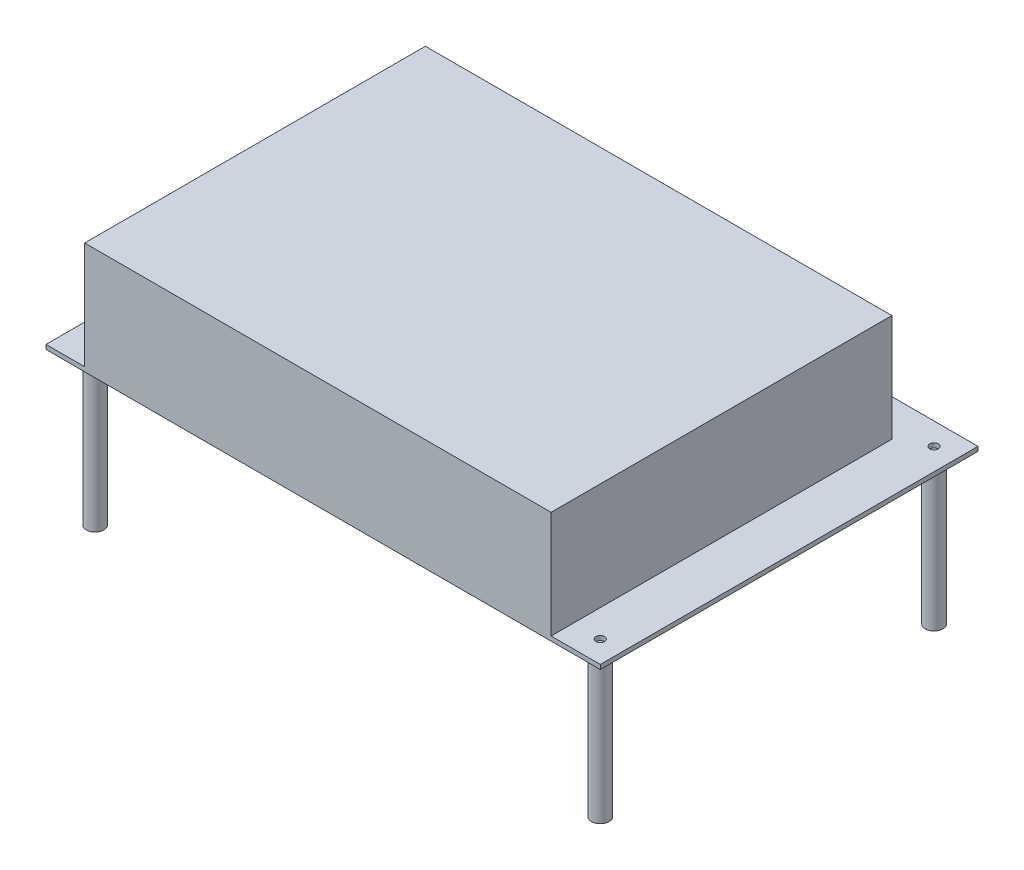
ISO-10303-21;
HEADER;
FILE_DESCRIPTION(('STEP AP214'),'2;1');
FILE_NAME('part.step','',(''),(''),'','','');
FILE_SCHEMA(('AUTOMOTIVE_DESIGN { 1 0 10303 214 1 1 1 1 }'));
ENDSEC;
DATA;
#1=APPLICATION_CONTEXT('core data for automotive mechanical design processes');
#2=APPLICATION_PROTOCOL_DEFINITION('international standard','automotive_design',2000,#1);
#3=PRODUCT_CONTEXT('',#1,'mechanical');
#4=PRODUCT('Part','Part','',(#3));
#5=PRODUCT_RELATED_PRODUCT_CATEGORY('part','',(#4));
#6=PRODUCT_DEFINITION_FORMATION('','',#4);
#7=PRODUCT_DEFINITION_CONTEXT('part definition',#1,'design');
#8=PRODUCT_DEFINITION('design','',#6,#7);
#9=PRODUCT_DEFINITION_SHAPE('','',#8);
#10=(LENGTH_UNIT() NAMED_UNIT(*) SI_UNIT(.MILLI.,.METRE.));
#11=(NAMED_UNIT(*) PLANE_ANGLE_UNIT() SI_UNIT($,.RADIAN.));
#12=(NAMED_UNIT(*) SI_UNIT($,.STERADIAN.) SOLID_ANGLE_UNIT());
#13=UNCERTAINTY_MEASURE_WITH_UNIT(LENGTH_MEASURE(1.E-05),#10,'distance_accuracy_value','');
#14=(GEOMETRIC_REPRESENTATION_CONTEXT(3) GLOBAL_UNCERTAINTY_ASSIGNED_CONTEXT((#13)) GLOBAL_UNIT_ASSIGNED_CONTEXT((#10,
#11,#12)) REPRESENTATION_CONTEXT('',''));
#15=CARTESIAN_POINT('',(0.,0.,0.));
#16=DIRECTION('',(0.,0.,1.));
#17=DIRECTION('',(1.,0.,0.));
#18=AXIS2_PLACEMENT_3D('',#15,#16,#17);
#19=CARTESIAN_POINT('',(0.,1.27,0.));
#20=DIRECTION('',(0.,-1.,0.));
#21=DIRECTION('',(0.,0.,-1.));
#22=AXIS2_PLACEMENT_3D('',#19,#20,#21);
#23=PLANE('',#22);
#24=CARTESIAN_POINT('',(7.87399999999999,1.27,-102.87));
#25=DIRECTION('',(0.,-1.,0.));
#26=DIRECTION('',(0.,0.,-1.));
#27=AXIS2_PLACEMENT_3D('',#24,#25,#26);
#28=CIRCLE('',#27,1.25);
#29=CARTESIAN_POINT('',(7.87399999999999,1.27,-104.12));
#30=VERTEX_POINT('',#29);
#31=EDGE_CURVE('E457',#30,#30,#28,.T.);
#32=ORIENTED_EDGE('',*,*,#31,.T.);
#33=EDGE_LOOP('',(#32));
#34=FACE_BOUND('',#33,.T.);
#35=CARTESIAN_POINT('',(7.87399999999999,1.27,-6.35));
#36=DIRECTION('',(0.,-1.,0.));
#37=DIRECTION('',(0.,0.,-1.));
#38=AXIS2_PLACEMENT_3D('',#35,#36,#37);
#39=CIRCLE('',#38,1.25);
#40=CARTESIAN_POINT('',(7.87399999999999,1.27,-7.6));
#41=VERTEX_POINT('',#40);
#42=EDGE_CURVE('E459',#41,#41,#39,.T.);
#43=ORIENTED_EDGE('',*,*,#42,.T.);
#44=EDGE_LOOP('',(#43));
#45=FACE_BOUND('',#44,.T.);
#46=CARTESIAN_POINT('',(153.924,1.27,-102.87));
#47=DIRECTION('',(0.,-1.,0.));
#48=DIRECTION('',(0.,0.,-1.));
#49=AXIS2_PLACEMENT_3D('',#46,#47,#48);
#50=CIRCLE('',#49,1.25000000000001);
#51=CARTESIAN_POINT('',(153.924,1.27,-104.12));
#52=VERTEX_POINT('',#51);
#53=EDGE_CURVE('E462',#52,#52,#50,.T.);
#54=ORIENTED_EDGE('',*,*,#53,.T.);
#55=EDGE_LOOP('',(#54));
#56=FACE_BOUND('',#55,.T.);
#57=CARTESIAN_POINT('',(153.924,1.27,-6.35));
#58=DIRECTION('',(0.,-1.,0.));
#59=DIRECTION('',(0.,0.,-1.));
#60=AXIS2_PLACEMENT_3D('',#57,#58,#59);
#61=CIRCLE('',#60,1.25000000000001);
#62=CARTESIAN_POINT('',(153.924,1.27,-7.60000000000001));
#63=VERTEX_POINT('',#62);
#64=EDGE_CURVE('E465',#63,#63,#61,.T.);
#65=ORIENTED_EDGE('',*,*,#64,.T.);
#66=EDGE_LOOP('',(#65));
#67=FACE_BOUND('',#66,.T.);
#68=DIRECTION('',(0.,0.,1.));
#69=VECTOR('',#68,1.);
#70=CARTESIAN_POINT('',(11.176,1.27,0.));
#71=LINE('',#70,#69);
#72=CARTESIAN_POINT('',(11.176,1.27,-98.5328741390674));
#73=VERTEX_POINT('',#72);
#74=CARTESIAN_POINT('',(11.176,1.27,0.));
#75=VERTEX_POINT('',#74);
#76=EDGE_CURVE('E37',#73,#75,#71,.T.);
#77=ORIENTED_EDGE('',*,*,#76,.F.);
#78=DIRECTION('',(-1.,0.,0.));
#79=VECTOR('',#78,1.);
#80=CARTESIAN_POINT('',(11.176,1.27,-98.5328741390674));
#81=LINE('',#80,#79);
#82=CARTESIAN_POINT('',(146.05,1.27,-98.5328741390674));
#83=VERTEX_POINT('',#82);
#84=EDGE_CURVE('E118',#83,#73,#81,.T.);
#85=ORIENTED_EDGE('',*,*,#84,.F.);
#86=DIRECTION('',(0.,0.,-1.));
#87=VECTOR('',#86,1.);
#88=CARTESIAN_POINT('',(146.05,1.27,0.));
#89=LINE('',#88,#87);
#90=CARTESIAN_POINT('',(146.05,1.27,0.));
#91=VERTEX_POINT('',#90);
#92=EDGE_CURVE('E56',#91,#83,#89,.T.);
#93=ORIENTED_EDGE('',*,*,#92,.F.);
#94=DIRECTION('',(1.,0.,0.));
#95=VECTOR('',#94,1.);
#96=CARTESIAN_POINT('',(0.,1.27,0.));
#97=LINE('',#96,#95);
#98=CARTESIAN_POINT('',(160.274,1.27,0.));
#99=VERTEX_POINT('',#98);
#100=EDGE_CURVE('E135',#91,#99,#97,.T.);
#101=ORIENTED_EDGE('',*,*,#100,.T.);
#102=DIRECTION('',(0.,0.,-1.));
#103=VECTOR('',#102,1.);
#104=CARTESIAN_POINT('',(160.274,1.27,0.));
#105=LINE('',#104,#103);
#106=CARTESIAN_POINT('',(160.274,1.27,-109.22));
#107=VERTEX_POINT('',#106);
#108=EDGE_CURVE('E144',#99,#107,#105,.T.);
#109=ORIENTED_EDGE('',*,*,#108,.T.);
#110=DIRECTION('',(-1.,0.,0.));
#111=VECTOR('',#110,1.);
#112=CARTESIAN_POINT('',(0.,1.27,-109.22));
#113=LINE('',#112,#111);
#114=CARTESIAN_POINT('',(0.,1.27,-109.22));
#115=VERTEX_POINT('',#114);
#116=EDGE_CURVE('E147',#107,#115,#113,.T.);
#117=ORIENTED_EDGE('',*,*,#116,.T.);
#118=DIRECTION('',(0.,0.,1.));
#119=VECTOR('',#118,1.);
#120=CARTESIAN_POINT('',(0.,1.27,0.));
#121=LINE('',#120,#119);
#122=CARTESIAN_POINT('',(0.,1.27,0.));
#123=VERTEX_POINT('',#122);
#124=EDGE_CURVE('E139',#115,#123,#121,.T.);
#125=ORIENTED_EDGE('',*,*,#124,.T.);
#126=EDGE_CURVE('E138',#123,#75,#97,.T.);
#127=ORIENTED_EDGE('',*,*,#126,.T.);
#128=EDGE_LOOP('',(#77,#85,#93,#101,#109,#117,#125,#127));
#129=FACE_BOUND('',#128,.T.);
#130=ADVANCED_FACE('F33',(#34,#45,#56,#67,#129),#23,.F.);
#131=CARTESIAN_POINT('',(0.,1.27,0.));
#132=DIRECTION('',(1.,0.,0.));
#133=DIRECTION('',(0.,0.,-1.));
#134=AXIS2_PLACEMENT_3D('',#131,#132,#133);
#135=PLANE('',#134);
#136=DIRECTION('',(0.,0.,1.));
#137=VECTOR('',#136,1.);
#138=CARTESIAN_POINT('',(0.,0.,0.));
#139=LINE('',#138,#137);
#140=CARTESIAN_POINT('',(0.,0.,-109.22));
#141=VERTEX_POINT('',#140);
#142=CARTESIAN_POINT('',(0.,0.,0.));
#143=VERTEX_POINT('',#142);
#144=EDGE_CURVE('E121',#141,#143,#139,.T.);
#145=ORIENTED_EDGE('',*,*,#144,.T.);
#146=DIRECTION('',(0.,-1.,0.));
#147=VECTOR('',#146,1.);
#148=CARTESIAN_POINT('',(0.,1.27,0.));
#149=LINE('',#148,#147);
#150=EDGE_CURVE('E11',#123,#143,#149,.T.);
#151=ORIENTED_EDGE('',*,*,#150,.F.);
#152=ORIENTED_EDGE('',*,*,#124,.F.);
#153=DIRECTION('',(0.,-1.,0.));
#154=VECTOR('',#153,1.);
#155=CARTESIAN_POINT('',(0.,1.27,-109.22));
#156=LINE('',#155,#154);
#157=EDGE_CURVE('E148',#115,#141,#156,.T.);
#158=ORIENTED_EDGE('',*,*,#157,.T.);
#159=EDGE_LOOP('',(#145,#151,#152,#158));
#160=FACE_BOUND('',#159,.T.);
#161=ADVANCED_FACE('F35',(#160),#135,.F.);
#162=CARTESIAN_POINT('',(0.,1.27,0.));
#163=DIRECTION('',(0.,0.,-1.));
#164=DIRECTION('',(-1.,0.,0.));
#165=AXIS2_PLACEMENT_3D('',#162,#163,#164);
#166=PLANE('',#165);
#167=DIRECTION('',(1.,0.,0.));
#168=VECTOR('',#167,1.);
#169=CARTESIAN_POINT('',(0.,0.,0.));
#170=LINE('',#169,#168);
#171=CARTESIAN_POINT('',(160.274,0.,0.));
#172=VERTEX_POINT('',#171);
#173=EDGE_CURVE('E124',#143,#172,#170,.T.);
#174=ORIENTED_EDGE('',*,*,#173,.T.);
#175=DIRECTION('',(0.,-1.,0.));
#176=VECTOR('',#175,1.);
#177=CARTESIAN_POINT('',(160.274,1.27,0.));
#178=LINE('',#177,#176);
#179=EDGE_CURVE('E43',#99,#172,#178,.T.);
#180=ORIENTED_EDGE('',*,*,#179,.F.);
#181=ORIENTED_EDGE('',*,*,#100,.F.);
#182=DIRECTION('',(0.,-1.,0.));
#183=VECTOR('',#182,1.);
#184=CARTESIAN_POINT('',(146.05,32.258,0.));
#185=LINE('',#184,#183);
#186=CARTESIAN_POINT('',(146.05,32.258,0.));
#187=VERTEX_POINT('',#186);
#188=EDGE_CURVE('E105',#187,#91,#185,.T.);
#189=ORIENTED_EDGE('',*,*,#188,.F.);
#190=DIRECTION('',(1.,0.,0.));
#191=VECTOR('',#190,1.);
#192=CARTESIAN_POINT('',(11.176,32.258,0.));
#193=LINE('',#192,#191);
#194=CARTESIAN_POINT('',(11.176,32.258,0.));
#195=VERTEX_POINT('',#194);
#196=EDGE_CURVE('E99',#195,#187,#193,.T.);
#197=ORIENTED_EDGE('',*,*,#196,.F.);
#198=DIRECTION('',(0.,-1.,0.));
#199=VECTOR('',#198,1.);
#200=CARTESIAN_POINT('',(11.176,32.258,0.));
#201=LINE('',#200,#199);
#202=EDGE_CURVE('E103',#195,#75,#201,.T.);
#203=ORIENTED_EDGE('',*,*,#202,.T.);
#204=ORIENTED_EDGE('',*,*,#126,.F.);
#205=ORIENTED_EDGE('',*,*,#150,.T.);
#206=EDGE_LOOP('',(#174,#180,#181,#189,#197,#203,#204,#205));
#207=FACE_BOUND('',#206,.T.);
#208=ADVANCED_FACE('F101',(#207),#166,.F.);
#209=CARTESIAN_POINT('',(160.274,1.27,0.));
#210=DIRECTION('',(-1.,0.,0.));
#211=DIRECTION('',(0.,0.,1.));
#212=AXIS2_PLACEMENT_3D('',#209,#210,#211);
#213=PLANE('',#212);
#214=DIRECTION('',(0.,0.,-1.));
#215=VECTOR('',#214,1.);
#216=CARTESIAN_POINT('',(160.274,0.,0.));
#217=LINE('',#216,#215);
#218=CARTESIAN_POINT('',(160.274,0.,-109.22));
#219=VERTEX_POINT('',#218);
#220=EDGE_CURVE('E151',#172,#219,#217,.T.);
#221=ORIENTED_EDGE('',*,*,#220,.T.);
#222=DIRECTION('',(0.,-1.,0.));
#223=VECTOR('',#222,1.);
#224=CARTESIAN_POINT('',(160.274,1.27,-109.22));
#225=LINE('',#224,#223);
#226=EDGE_CURVE('E157',#107,#219,#225,.T.);
#227=ORIENTED_EDGE('',*,*,#226,.F.);
#228=ORIENTED_EDGE('',*,*,#108,.F.);
#229=ORIENTED_EDGE('',*,*,#179,.T.);
#230=EDGE_LOOP('',(#221,#227,#228,#229));
#231=FACE_BOUND('',#230,.T.);
#232=ADVANCED_FACE('F165',(#231),#213,.F.);
#233=CARTESIAN_POINT('',(0.,1.27,-109.22));
#234=DIRECTION('',(0.,0.,1.));
#235=DIRECTION('',(1.,0.,0.));
#236=AXIS2_PLACEMENT_3D('',#233,#234,#235);
#237=PLANE('',#236);
#238=DIRECTION('',(-1.,0.,0.));
#239=VECTOR('',#238,1.);
#240=CARTESIAN_POINT('',(0.,0.,-109.22));
#241=LINE('',#240,#239);
#242=EDGE_CURVE('E153',#219,#141,#241,.T.);
#243=ORIENTED_EDGE('',*,*,#242,.T.);
#244=ORIENTED_EDGE('',*,*,#157,.F.);
#245=ORIENTED_EDGE('',*,*,#116,.F.);
#246=ORIENTED_EDGE('',*,*,#226,.T.);
#247=EDGE_LOOP('',(#243,#244,#245,#246));
#248=FACE_BOUND('',#247,.T.);
#249=ADVANCED_FACE('F173',(#248),#237,.F.);
#250=CARTESIAN_POINT('',(0.,0.,0.));
#251=DIRECTION('',(0.,-1.,0.));
#252=DIRECTION('',(0.,0.,-1.));
#253=AXIS2_PLACEMENT_3D('',#250,#251,#252);
#254=PLANE('',#253);
#255=CARTESIAN_POINT('',(153.924,0.,-102.87));
#256=DIRECTION('',(0.,-1.,0.));
#257=DIRECTION('',(0.,0.,-1.));
#258=AXIS2_PLACEMENT_3D('',#255,#256,#257);
#259=CIRCLE('',#258,2.53999999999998);
#260=CARTESIAN_POINT('',(153.924,0.,-105.41));
#261=VERTEX_POINT('',#260);
#262=EDGE_CURVE('E423',#261,#261,#259,.T.);
#263=ORIENTED_EDGE('',*,*,#262,.F.);
#264=EDGE_LOOP('',(#263));
#265=FACE_BOUND('',#264,.T.);
#266=CARTESIAN_POINT('',(7.87399999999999,0.,-102.87));
#267=DIRECTION('',(0.,-1.,0.));
#268=DIRECTION('',(0.,0.,-1.));
#269=AXIS2_PLACEMENT_3D('',#266,#267,#268);
#270=CIRCLE('',#269,2.54);
#271=CARTESIAN_POINT('',(7.87399999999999,0.,-105.41));
#272=VERTEX_POINT('',#271);
#273=EDGE_CURVE('E426',#272,#272,#270,.T.);
#274=ORIENTED_EDGE('',*,*,#273,.F.);
#275=EDGE_LOOP('',(#274));
#276=FACE_BOUND('',#275,.T.);
#277=CARTESIAN_POINT('',(153.924,0.,-6.35));
#278=DIRECTION('',(0.,-1.,0.));
#279=DIRECTION('',(0.,0.,-1.));
#280=AXIS2_PLACEMENT_3D('',#277,#278,#279);
#281=CIRCLE('',#280,2.53999999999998);
#282=CARTESIAN_POINT('',(153.924,0.,-8.88999999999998));
#283=VERTEX_POINT('',#282);
#284=EDGE_CURVE('E439',#283,#283,#281,.T.);
#285=ORIENTED_EDGE('',*,*,#284,.F.);
#286=EDGE_LOOP('',(#285));
#287=FACE_BOUND('',#286,.T.);
#288=CARTESIAN_POINT('',(7.87399999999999,0.,-6.35));
#289=DIRECTION('',(0.,-1.,0.));
#290=DIRECTION('',(0.,0.,-1.));
#291=AXIS2_PLACEMENT_3D('',#288,#289,#290);
#292=CIRCLE('',#291,2.54);
#293=CARTESIAN_POINT('',(7.87399999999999,0.,-8.89));
#294=VERTEX_POINT('',#293);
#295=EDGE_CURVE('E448',#294,#294,#292,.T.);
#296=ORIENTED_EDGE('',*,*,#295,.F.);
#297=EDGE_LOOP('',(#296));
#298=FACE_BOUND('',#297,.T.);
#299=ORIENTED_EDGE('',*,*,#144,.F.);
#300=ORIENTED_EDGE('',*,*,#242,.F.);
#301=ORIENTED_EDGE('',*,*,#220,.F.);
#302=ORIENTED_EDGE('',*,*,#173,.F.);
#303=EDGE_LOOP('',(#299,#300,#301,#302));
#304=FACE_BOUND('',#303,.T.);
#305=ADVANCED_FACE('F170',(#265,#276,#287,#298,#304),#254,.T.);
#306=CARTESIAN_POINT('',(11.176,32.258,0.));
#307=DIRECTION('',(1.,0.,0.));
#308=DIRECTION('',(0.,0.,-1.));
#309=AXIS2_PLACEMENT_3D('',#306,#307,#308);
#310=PLANE('',#309);
#311=ORIENTED_EDGE('',*,*,#76,.T.);
#312=ORIENTED_EDGE('',*,*,#202,.F.);
#313=DIRECTION('',(0.,0.,1.));
#314=VECTOR('',#313,1.);
#315=CARTESIAN_POINT('',(11.176,32.258,0.));
#316=LINE('',#315,#314);
#317=CARTESIAN_POINT('',(11.176,32.258,-98.5328741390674));
#318=VERTEX_POINT('',#317);
#319=EDGE_CURVE('E109',#318,#195,#316,.T.);
#320=ORIENTED_EDGE('',*,*,#319,.F.);
#321=DIRECTION('',(0.,-1.,0.));
#322=VECTOR('',#321,1.);
#323=CARTESIAN_POINT('',(11.176,32.258,-98.5328741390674));
#324=LINE('',#323,#322);
#325=EDGE_CURVE('E184',#318,#73,#324,.T.);
#326=ORIENTED_EDGE('',*,*,#325,.T.);
#327=EDGE_LOOP('',(#311,#312,#320,#326));
#328=FACE_BOUND('',#327,.T.);
#329=ADVANCED_FACE('F120',(#328),#310,.F.);
#330=CARTESIAN_POINT('',(146.05,32.258,0.));
#331=DIRECTION('',(-1.,0.,0.));
#332=DIRECTION('',(0.,0.,1.));
#333=AXIS2_PLACEMENT_3D('',#330,#331,#332);
#334=PLANE('',#333);
#335=ORIENTED_EDGE('',*,*,#92,.T.);
#336=DIRECTION('',(0.,-1.,0.));
#337=VECTOR('',#336,1.);
#338=CARTESIAN_POINT('',(146.05,32.258,-98.5328741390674));
#339=LINE('',#338,#337);
#340=CARTESIAN_POINT('',(146.05,32.258,-98.5328741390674));
#341=VERTEX_POINT('',#340);
#342=EDGE_CURVE('E126',#341,#83,#339,.T.);
#343=ORIENTED_EDGE('',*,*,#342,.F.);
#344=DIRECTION('',(0.,0.,-1.));
#345=VECTOR('',#344,1.);
#346=CARTESIAN_POINT('',(146.05,32.258,0.));
#347=LINE('',#346,#345);
#348=EDGE_CURVE('E108',#187,#341,#347,.T.);
#349=ORIENTED_EDGE('',*,*,#348,.F.);
#350=ORIENTED_EDGE('',*,*,#188,.T.);
#351=EDGE_LOOP('',(#335,#343,#349,#350));
#352=FACE_BOUND('',#351,.T.);
#353=ADVANCED_FACE('F180',(#352),#334,.F.);
#354=CARTESIAN_POINT('',(11.176,32.258,-98.5328741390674));
#355=DIRECTION('',(0.,0.,1.));
#356=DIRECTION('',(1.,0.,0.));
#357=AXIS2_PLACEMENT_3D('',#354,#355,#356);
#358=PLANE('',#357);
#359=ORIENTED_EDGE('',*,*,#84,.T.);
#360=ORIENTED_EDGE('',*,*,#325,.F.);
#361=DIRECTION('',(-1.,0.,0.));
#362=VECTOR('',#361,1.);
#363=CARTESIAN_POINT('',(11.176,32.258,-98.5328741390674));
#364=LINE('',#363,#362);
#365=EDGE_CURVE('E114',#341,#318,#364,.T.);
#366=ORIENTED_EDGE('',*,*,#365,.F.);
#367=ORIENTED_EDGE('',*,*,#342,.T.);
#368=EDGE_LOOP('',(#359,#360,#366,#367));
#369=FACE_BOUND('',#368,.T.);
#370=ADVANCED_FACE('F190',(#369),#358,.F.);
#371=CARTESIAN_POINT('',(0.,32.258,0.));
#372=DIRECTION('',(0.,-1.,0.));
#373=DIRECTION('',(0.,0.,-1.));
#374=AXIS2_PLACEMENT_3D('',#371,#372,#373);
#375=PLANE('',#374);
#376=ORIENTED_EDGE('',*,*,#319,.T.);
#377=ORIENTED_EDGE('',*,*,#196,.T.);
#378=ORIENTED_EDGE('',*,*,#348,.T.);
#379=ORIENTED_EDGE('',*,*,#365,.T.);
#380=EDGE_LOOP('',(#376,#377,#378,#379));
#381=FACE_BOUND('',#380,.T.);
#382=ADVANCED_FACE('F112',(#381),#375,.F.);
#383=CARTESIAN_POINT('',(153.924,30.988,-6.35));
#384=DIRECTION('',(0.,-1.,0.));
#385=DIRECTION('',(0.,0.,-1.));
#386=AXIS2_PLACEMENT_3D('',#383,#384,#385);
#387=CYLINDRICAL_SURFACE('',#386,1.25000000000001);
#388=CARTESIAN_POINT('',(153.924,0.,-6.35));
#389=DIRECTION('',(0.,-1.,0.));
#390=DIRECTION('',(0.,0.,-1.));
#391=AXIS2_PLACEMENT_3D('',#388,#389,#390);
#392=CIRCLE('',#391,1.25000000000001);
#393=CARTESIAN_POINT('',(153.924,0.,-7.60000000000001));
#394=VERTEX_POINT('',#393);
#395=EDGE_CURVE('E443',#394,#394,#392,.F.);
#396=ORIENTED_EDGE('',*,*,#395,.F.);
#397=EDGE_LOOP('',(#396));
#398=FACE_BOUND('',#397,.T.);
#399=ORIENTED_EDGE('',*,*,#64,.F.);
#400=EDGE_LOOP('',(#399));
#401=FACE_BOUND('',#400,.T.);
#402=ADVANCED_FACE('F197',(#398,#401),#387,.F.);
#403=CARTESIAN_POINT('',(153.924,30.988,-102.87));
#404=DIRECTION('',(0.,-1.,0.));
#405=DIRECTION('',(0.,0.,-1.));
#406=AXIS2_PLACEMENT_3D('',#403,#404,#405);
#407=CYLINDRICAL_SURFACE('',#406,1.25000000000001);
#408=CARTESIAN_POINT('',(153.924,0.,-102.87));
#409=DIRECTION('',(0.,-1.,0.));
#410=DIRECTION('',(0.,0.,-1.));
#411=AXIS2_PLACEMENT_3D('',#408,#409,#410);
#412=CIRCLE('',#411,1.25000000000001);
#413=CARTESIAN_POINT('',(153.924,0.,-104.12));
#414=VERTEX_POINT('',#413);
#415=EDGE_CURVE('E422',#414,#414,#412,.F.);
#416=ORIENTED_EDGE('',*,*,#415,.F.);
#417=EDGE_LOOP('',(#416));
#418=FACE_BOUND('',#417,.T.);
#419=ORIENTED_EDGE('',*,*,#53,.F.);
#420=EDGE_LOOP('',(#419));
#421=FACE_BOUND('',#420,.T.);
#422=ADVANCED_FACE('F263',(#418,#421),#407,.F.);
#423=CARTESIAN_POINT('',(7.87399999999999,30.988,-6.35));
#424=DIRECTION('',(0.,-1.,0.));
#425=DIRECTION('',(0.,0.,-1.));
#426=AXIS2_PLACEMENT_3D('',#423,#424,#425);
#427=CYLINDRICAL_SURFACE('',#426,1.25);
#428=CARTESIAN_POINT('',(7.87399999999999,0.,-6.35));
#429=DIRECTION('',(0.,-1.,0.));
#430=DIRECTION('',(0.,0.,-1.));
#431=AXIS2_PLACEMENT_3D('',#428,#429,#430);
#432=CIRCLE('',#431,1.25);
#433=CARTESIAN_POINT('',(7.87399999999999,0.,-7.6));
#434=VERTEX_POINT('',#433);
#435=EDGE_CURVE('E452',#434,#434,#432,.F.);
#436=ORIENTED_EDGE('',*,*,#435,.F.);
#437=EDGE_LOOP('',(#436));
#438=FACE_BOUND('',#437,.T.);
#439=ORIENTED_EDGE('',*,*,#42,.F.);
#440=EDGE_LOOP('',(#439));
#441=FACE_BOUND('',#440,.T.);
#442=ADVANCED_FACE('F272',(#438,#441),#427,.F.);
#443=CARTESIAN_POINT('',(7.87399999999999,30.988,-102.87));
#444=DIRECTION('',(0.,-1.,0.));
#445=DIRECTION('',(0.,0.,-1.));
#446=AXIS2_PLACEMENT_3D('',#443,#444,#445);
#447=CYLINDRICAL_SURFACE('',#446,1.25);
#448=CARTESIAN_POINT('',(7.87399999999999,0.,-102.87));
#449=DIRECTION('',(0.,-1.,0.));
#450=DIRECTION('',(0.,0.,-1.));
#451=AXIS2_PLACEMENT_3D('',#448,#449,#450);
#452=CIRCLE('',#451,1.25);
#453=CARTESIAN_POINT('',(7.87399999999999,0.,-104.12));
#454=VERTEX_POINT('',#453);
#455=EDGE_CURVE('E434',#454,#454,#452,.F.);
#456=ORIENTED_EDGE('',*,*,#455,.F.);
#457=EDGE_LOOP('',(#456));
#458=FACE_BOUND('',#457,.T.);
#459=ORIENTED_EDGE('',*,*,#31,.F.);
#460=EDGE_LOOP('',(#459));
#461=FACE_BOUND('',#460,.T.);
#462=ADVANCED_FACE('F286',(#458,#461),#447,.F.);
#463=CARTESIAN_POINT('',(7.87399999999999,0.,-6.35));
#464=DIRECTION('',(0.,-1.,0.));
#465=DIRECTION('',(0.,0.,-1.));
#466=AXIS2_PLACEMENT_3D('',#463,#464,#465);
#467=PLANE('',#466);
#468=ORIENTED_EDGE('',*,*,#435,.T.);
#469=EDGE_LOOP('',(#468));
#470=FACE_BOUND('',#469,.T.);
#471=ADVANCED_FACE('F295',(#470),#467,.F.);
#472=CARTESIAN_POINT('',(7.87399999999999,-43.18,-6.35));
#473=DIRECTION('',(0.,1.,0.));
#474=DIRECTION('',(0.,0.,1.));
#475=AXIS2_PLACEMENT_3D('',#472,#473,#474);
#476=CYLINDRICAL_SURFACE('',#475,2.54);
#477=CARTESIAN_POINT('',(7.87399999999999,-43.18,-6.35));
#478=DIRECTION('',(0.,-1.,0.));
#479=DIRECTION('',(0.,0.,-1.));
#480=AXIS2_PLACEMENT_3D('',#477,#478,#479);
#481=CIRCLE('',#480,2.54);
#482=CARTESIAN_POINT('',(7.87399999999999,-43.18,-8.89));
#483=VERTEX_POINT('',#482);
#484=EDGE_CURVE('E449',#483,#483,#481,.T.);
#485=ORIENTED_EDGE('',*,*,#484,.F.);
#486=EDGE_LOOP('',(#485));
#487=FACE_BOUND('',#486,.T.);
#488=ORIENTED_EDGE('',*,*,#295,.T.);
#489=EDGE_LOOP('',(#488));
#490=FACE_BOUND('',#489,.T.);
#491=ADVANCED_FACE('F305',(#487,#490),#476,.T.);
#492=CARTESIAN_POINT('',(7.87399999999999,-43.18,-6.35));
#493=DIRECTION('',(0.,-1.,0.));
#494=DIRECTION('',(0.,0.,-1.));
#495=AXIS2_PLACEMENT_3D('',#492,#493,#494);
#496=PLANE('',#495);
#497=ORIENTED_EDGE('',*,*,#484,.T.);
#498=EDGE_LOOP('',(#497));
#499=FACE_BOUND('',#498,.T.);
#500=ADVANCED_FACE('F312',(#499),#496,.T.);
#501=CARTESIAN_POINT('',(153.924,0.,-6.35));
#502=DIRECTION('',(0.,-1.,0.));
#503=DIRECTION('',(0.,0.,-1.));
#504=AXIS2_PLACEMENT_3D('',#501,#502,#503);
#505=PLANE('',#504);
#506=ORIENTED_EDGE('',*,*,#395,.T.);
#507=EDGE_LOOP('',(#506));
#508=FACE_BOUND('',#507,.T.);
#509=ADVANCED_FACE('F320',(#508),#505,.F.);
#510=CARTESIAN_POINT('',(153.924,-43.18,-6.35));
#511=DIRECTION('',(0.,1.,0.));
#512=DIRECTION('',(0.,0.,1.));
#513=AXIS2_PLACEMENT_3D('',#510,#511,#512);
#514=CYLINDRICAL_SURFACE('',#513,2.53999999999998);
#515=CARTESIAN_POINT('',(153.924,-43.18,-6.35));
#516=DIRECTION('',(0.,-1.,0.));
#517=DIRECTION('',(0.,0.,-1.));
#518=AXIS2_PLACEMENT_3D('',#515,#516,#517);
#519=CIRCLE('',#518,2.53999999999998);
#520=CARTESIAN_POINT('',(153.924,-43.18,-8.88999999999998));
#521=VERTEX_POINT('',#520);
#522=EDGE_CURVE('E440',#521,#521,#519,.T.);
#523=ORIENTED_EDGE('',*,*,#522,.F.);
#524=EDGE_LOOP('',(#523));
#525=FACE_BOUND('',#524,.T.);
#526=ORIENTED_EDGE('',*,*,#284,.T.);
#527=EDGE_LOOP('',(#526));
#528=FACE_BOUND('',#527,.T.);
#529=ADVANCED_FACE('F328',(#525,#528),#514,.T.);
#530=CARTESIAN_POINT('',(153.924,-43.18,-6.35));
#531=DIRECTION('',(0.,-1.,0.));
#532=DIRECTION('',(0.,0.,-1.));
#533=AXIS2_PLACEMENT_3D('',#530,#531,#532);
#534=PLANE('',#533);
#535=ORIENTED_EDGE('',*,*,#522,.T.);
#536=EDGE_LOOP('',(#535));
#537=FACE_BOUND('',#536,.T.);
#538=ADVANCED_FACE('F336',(#537),#534,.T.);
#539=CARTESIAN_POINT('',(7.87399999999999,0.,-102.87));
#540=DIRECTION('',(0.,-1.,0.));
#541=DIRECTION('',(0.,0.,-1.));
#542=AXIS2_PLACEMENT_3D('',#539,#540,#541);
#543=PLANE('',#542);
#544=ORIENTED_EDGE('',*,*,#455,.T.);
#545=EDGE_LOOP('',(#544));
#546=FACE_BOUND('',#545,.T.);
#547=ADVANCED_FACE('F344',(#546),#543,.F.);
#548=CARTESIAN_POINT('',(7.87399999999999,-43.18,-102.87));
#549=DIRECTION('',(0.,1.,0.));
#550=DIRECTION('',(0.,0.,1.));
#551=AXIS2_PLACEMENT_3D('',#548,#549,#550);
#552=CYLINDRICAL_SURFACE('',#551,2.54);
#553=CARTESIAN_POINT('',(7.87399999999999,-43.18,-102.87));
#554=DIRECTION('',(0.,-1.,0.));
#555=DIRECTION('',(0.,0.,-1.));
#556=AXIS2_PLACEMENT_3D('',#553,#554,#555);
#557=CIRCLE('',#556,2.54);
#558=CARTESIAN_POINT('',(7.87399999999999,-43.18,-105.41));
#559=VERTEX_POINT('',#558);
#560=EDGE_CURVE('E431',#559,#559,#557,.T.);
#561=ORIENTED_EDGE('',*,*,#560,.F.);
#562=EDGE_LOOP('',(#561));
#563=FACE_BOUND('',#562,.T.);
#564=ORIENTED_EDGE('',*,*,#273,.T.);
#565=EDGE_LOOP('',(#564));
#566=FACE_BOUND('',#565,.T.);
#567=ADVANCED_FACE('F352',(#563,#566),#552,.T.);
#568=CARTESIAN_POINT('',(7.87399999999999,-43.18,-102.87));
#569=DIRECTION('',(0.,-1.,0.));
#570=DIRECTION('',(0.,0.,-1.));
#571=AXIS2_PLACEMENT_3D('',#568,#569,#570);
#572=PLANE('',#571);
#573=ORIENTED_EDGE('',*,*,#560,.T.);
#574=EDGE_LOOP('',(#573));
#575=FACE_BOUND('',#574,.T.);
#576=ADVANCED_FACE('F360',(#575),#572,.T.);
#577=CARTESIAN_POINT('',(153.924,0.,-102.87));
#578=DIRECTION('',(0.,-1.,0.));
#579=DIRECTION('',(0.,0.,-1.));
#580=AXIS2_PLACEMENT_3D('',#577,#578,#579);
#581=PLANE('',#580);
#582=ORIENTED_EDGE('',*,*,#415,.T.);
#583=EDGE_LOOP('',(#582));
#584=FACE_BOUND('',#583,.T.);
#585=ADVANCED_FACE('F368',(#584),#581,.F.);
#586=CARTESIAN_POINT('',(153.924,-43.18,-102.87));
#587=DIRECTION('',(0.,1.,0.));
#588=DIRECTION('',(0.,0.,1.));
#589=AXIS2_PLACEMENT_3D('',#586,#587,#588);
#590=CYLINDRICAL_SURFACE('',#589,2.53999999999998);
#591=CARTESIAN_POINT('',(153.924,-43.18,-102.87));
#592=DIRECTION('',(0.,-1.,0.));
#593=DIRECTION('',(0.,0.,-1.));
#594=AXIS2_PLACEMENT_3D('',#591,#592,#593);
#595=CIRCLE('',#594,2.53999999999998);
#596=CARTESIAN_POINT('',(153.924,-43.18,-105.41));
#597=VERTEX_POINT('',#596);
#598=EDGE_CURVE('E421',#597,#597,#595,.T.);
#599=ORIENTED_EDGE('',*,*,#598,.F.);
#600=EDGE_LOOP('',(#599));
#601=FACE_BOUND('',#600,.T.);
#602=ORIENTED_EDGE('',*,*,#262,.T.);
#603=EDGE_LOOP('',(#602));
#604=FACE_BOUND('',#603,.T.);
#605=ADVANCED_FACE('F376',(#601,#604),#590,.T.);
#606=CARTESIAN_POINT('',(153.924,-43.18,-102.87));
#607=DIRECTION('',(0.,-1.,0.));
#608=DIRECTION('',(0.,0.,-1.));
#609=AXIS2_PLACEMENT_3D('',#606,#607,#608);
#610=PLANE('',#609);
#611=ORIENTED_EDGE('',*,*,#598,.T.);
#612=EDGE_LOOP('',(#611));
#613=FACE_BOUND('',#612,.T.);
#614=ADVANCED_FACE('F384',(#613),#610,.T.);
#615=CLOSED_SHELL('',(#130,#161,#208,#232,#249,#305,#329,#353,#370,#382,#402,#422,#442,#462,
#471,#491,#500,#509,#529,#538,#547,#567,#576,#585,#605,#614));
#616=MANIFOLD_SOLID_BREP('B2',#615);
#617=ADVANCED_BREP_SHAPE_REPRESENTATION('',(#18,#616),#14);
#618=SHAPE_DEFINITION_REPRESENTATION(#9,#617);
ENDSEC;
END-ISO-10303-21;
